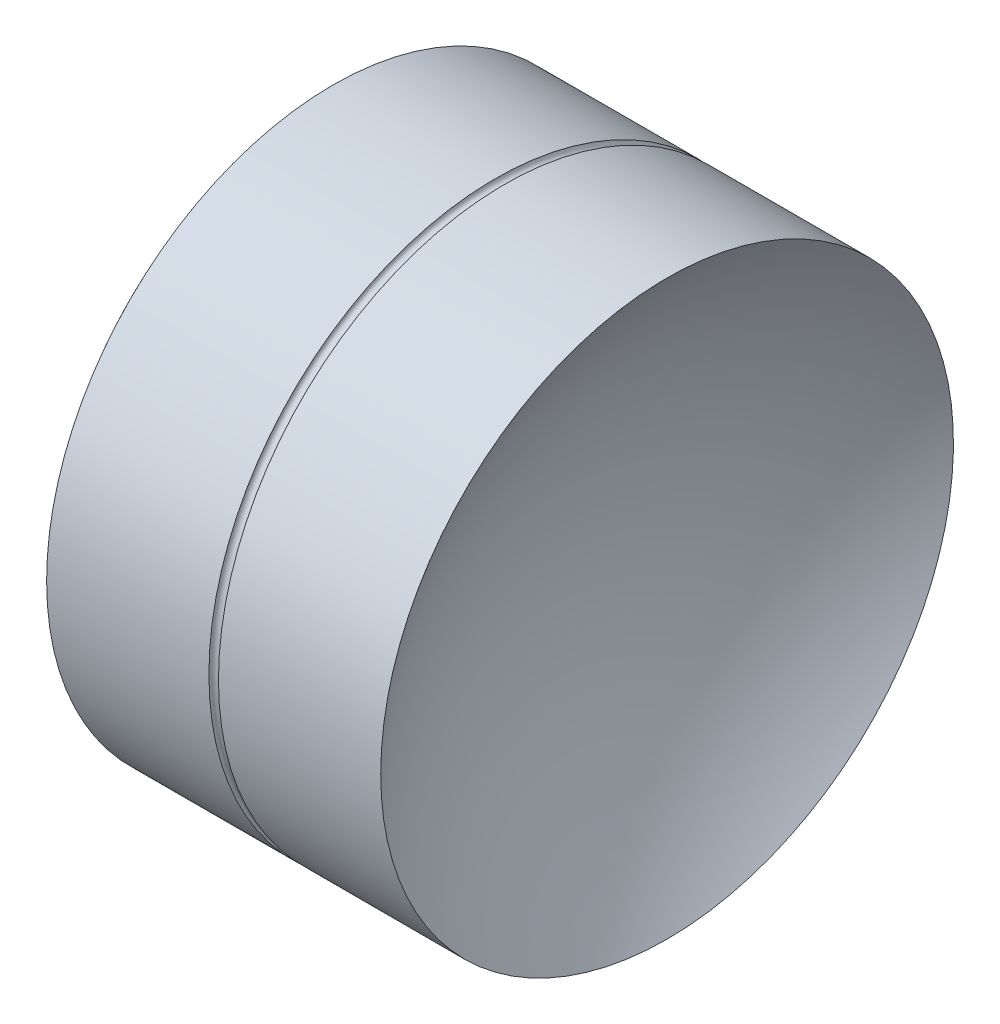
ISO-10303-21;
HEADER;
FILE_DESCRIPTION(('STEP AP214'),'2;1');
FILE_NAME('part.step','',(''),(''),'','','');
FILE_SCHEMA(('AUTOMOTIVE_DESIGN { 1 0 10303 214 1 1 1 1 }'));
ENDSEC;
DATA;
#1=APPLICATION_CONTEXT('core data for automotive mechanical design processes');
#2=APPLICATION_PROTOCOL_DEFINITION('international standard','automotive_design',2000,#1);
#3=PRODUCT_CONTEXT('',#1,'mechanical');
#4=PRODUCT('Part','Part','',(#3));
#5=PRODUCT_RELATED_PRODUCT_CATEGORY('part','',(#4));
#6=PRODUCT_DEFINITION_FORMATION('','',#4);
#7=PRODUCT_DEFINITION_CONTEXT('part definition',#1,'design');
#8=PRODUCT_DEFINITION('design','',#6,#7);
#9=PRODUCT_DEFINITION_SHAPE('','',#8);
#10=(LENGTH_UNIT() NAMED_UNIT(*) SI_UNIT(.MILLI.,.METRE.));
#11=(NAMED_UNIT(*) PLANE_ANGLE_UNIT() SI_UNIT($,.RADIAN.));
#12=(NAMED_UNIT(*) SI_UNIT($,.STERADIAN.) SOLID_ANGLE_UNIT());
#13=UNCERTAINTY_MEASURE_WITH_UNIT(LENGTH_MEASURE(1.E-05),#10,'distance_accuracy_value','');
#14=(GEOMETRIC_REPRESENTATION_CONTEXT(3) GLOBAL_UNCERTAINTY_ASSIGNED_CONTEXT((#13)) GLOBAL_UNIT_ASSIGNED_CONTEXT((#10,
#11,#12)) REPRESENTATION_CONTEXT('',''));
#15=CARTESIAN_POINT('',(0.,0.,0.));
#16=DIRECTION('',(0.,0.,1.));
#17=DIRECTION('',(1.,0.,0.));
#18=AXIS2_PLACEMENT_3D('',#15,#16,#17);
#19=CARTESIAN_POINT('',(14.7228719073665,0.,0.));
#20=DIRECTION('',(-1.,0.,0.));
#21=DIRECTION('',(0.,-1.,0.));
#22=AXIS2_PLACEMENT_3D('',#19,#20,#21);
#23=SPHERICAL_SURFACE('',#22,5.);
#24=CARTESIAN_POINT('',(10.7228719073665,0.,0.));
#25=DIRECTION('',(-1.,0.,0.));
#26=DIRECTION('',(0.,0.,1.));
#27=AXIS2_PLACEMENT_3D('',#24,#25,#26);
#28=CIRCLE('',#27,3.);
#29=CARTESIAN_POINT('',(10.7228719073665,0.,3.));
#30=VERTEX_POINT('',#29);
#31=EDGE_CURVE('E10',#30,#30,#28,.T.);
#32=ORIENTED_EDGE('',*,*,#31,.F.);
#33=EDGE_LOOP('',(#32));
#34=FACE_BOUND('',#33,.T.);
#35=ADVANCED_FACE('F24',(#34),#23,.F.);
#36=CARTESIAN_POINT('',(-64.5122961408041,0.,0.));
#37=DIRECTION('',(-1.,0.,0.));
#38=DIRECTION('',(0.,0.,1.));
#39=AXIS2_PLACEMENT_3D('',#36,#37,#38);
#40=CYLINDRICAL_SURFACE('',#39,3.);
#41=CARTESIAN_POINT('',(9.02287190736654,0.,0.));
#42=DIRECTION('',(-1.,0.,0.));
#43=DIRECTION('',(0.,0.,1.));
#44=AXIS2_PLACEMENT_3D('',#41,#42,#43);
#45=CIRCLE('',#44,3.);
#46=CARTESIAN_POINT('',(9.02287190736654,0.,3.));
#47=VERTEX_POINT('',#46);
#48=EDGE_CURVE('E30',#47,#47,#45,.T.);
#49=ORIENTED_EDGE('',*,*,#48,.F.);
#50=EDGE_LOOP('',(#49));
#51=FACE_BOUND('',#50,.T.);
#52=ORIENTED_EDGE('',*,*,#31,.T.);
#53=EDGE_LOOP('',(#52));
#54=FACE_BOUND('',#53,.T.);
#55=ADVANCED_FACE('F54',(#51,#54),#40,.T.);
#56=CARTESIAN_POINT('',(8.97287190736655,0.,0.));
#57=DIRECTION('',(-1.,0.,0.));
#58=DIRECTION('',(0.,0.,1.));
#59=AXIS2_PLACEMENT_3D('',#56,#57,#58);
#60=TOROIDAL_SURFACE('',#59,3.,0.0499999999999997);
#61=CARTESIAN_POINT('',(8.92287190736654,0.,0.));
#62=DIRECTION('',(-1.,0.,0.));
#63=DIRECTION('',(0.,0.,1.));
#64=AXIS2_PLACEMENT_3D('',#61,#62,#63);
#65=CIRCLE('',#64,3.);
#66=CARTESIAN_POINT('',(8.92287190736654,0.,3.));
#67=VERTEX_POINT('',#66);
#68=EDGE_CURVE('E34',#67,#67,#65,.T.);
#69=ORIENTED_EDGE('',*,*,#68,.F.);
#70=EDGE_LOOP('',(#69));
#71=FACE_BOUND('',#70,.T.);
#72=ORIENTED_EDGE('',*,*,#48,.T.);
#73=EDGE_LOOP('',(#72));
#74=FACE_BOUND('',#73,.T.);
#75=ADVANCED_FACE('F49',(#71,#74),#60,.F.);
#76=CARTESIAN_POINT('',(-64.5122961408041,0.,0.));
#77=DIRECTION('',(-1.,0.,0.));
#78=DIRECTION('',(0.,0.,1.));
#79=AXIS2_PLACEMENT_3D('',#76,#77,#78);
#80=CYLINDRICAL_SURFACE('',#79,3.);
#81=CARTESIAN_POINT('',(7.22287190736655,0.,0.));
#82=DIRECTION('',(-1.,0.,0.));
#83=DIRECTION('',(0.,0.,1.));
#84=AXIS2_PLACEMENT_3D('',#81,#82,#83);
#85=CIRCLE('',#84,3.);
#86=CARTESIAN_POINT('',(7.22287190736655,0.,3.));
#87=VERTEX_POINT('',#86);
#88=EDGE_CURVE('E38',#87,#87,#85,.T.);
#89=ORIENTED_EDGE('',*,*,#88,.F.);
#90=EDGE_LOOP('',(#89));
#91=FACE_BOUND('',#90,.T.);
#92=ORIENTED_EDGE('',*,*,#68,.T.);
#93=EDGE_LOOP('',(#92));
#94=FACE_BOUND('',#93,.T.);
#95=ADVANCED_FACE('F46',(#91,#94),#80,.T.);
#96=CARTESIAN_POINT('',(11.2228719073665,0.,0.));
#97=DIRECTION('',(-1.,0.,0.));
#98=DIRECTION('',(0.,1.,0.));
#99=AXIS2_PLACEMENT_3D('',#96,#97,#98);
#100=SPHERICAL_SURFACE('',#99,5.);
#101=ORIENTED_EDGE('',*,*,#88,.T.);
#102=EDGE_LOOP('',(#101));
#103=FACE_BOUND('',#102,.T.);
#104=ADVANCED_FACE('F44',(#103),#100,.T.);
#105=CLOSED_SHELL('',(#35,#55,#75,#95,#104));
#106=MANIFOLD_SOLID_BREP('B2',#105);
#107=ADVANCED_BREP_SHAPE_REPRESENTATION('',(#18,#106),#14);
#108=SHAPE_DEFINITION_REPRESENTATION(#9,#107);
ENDSEC;
END-ISO-10303-21;
